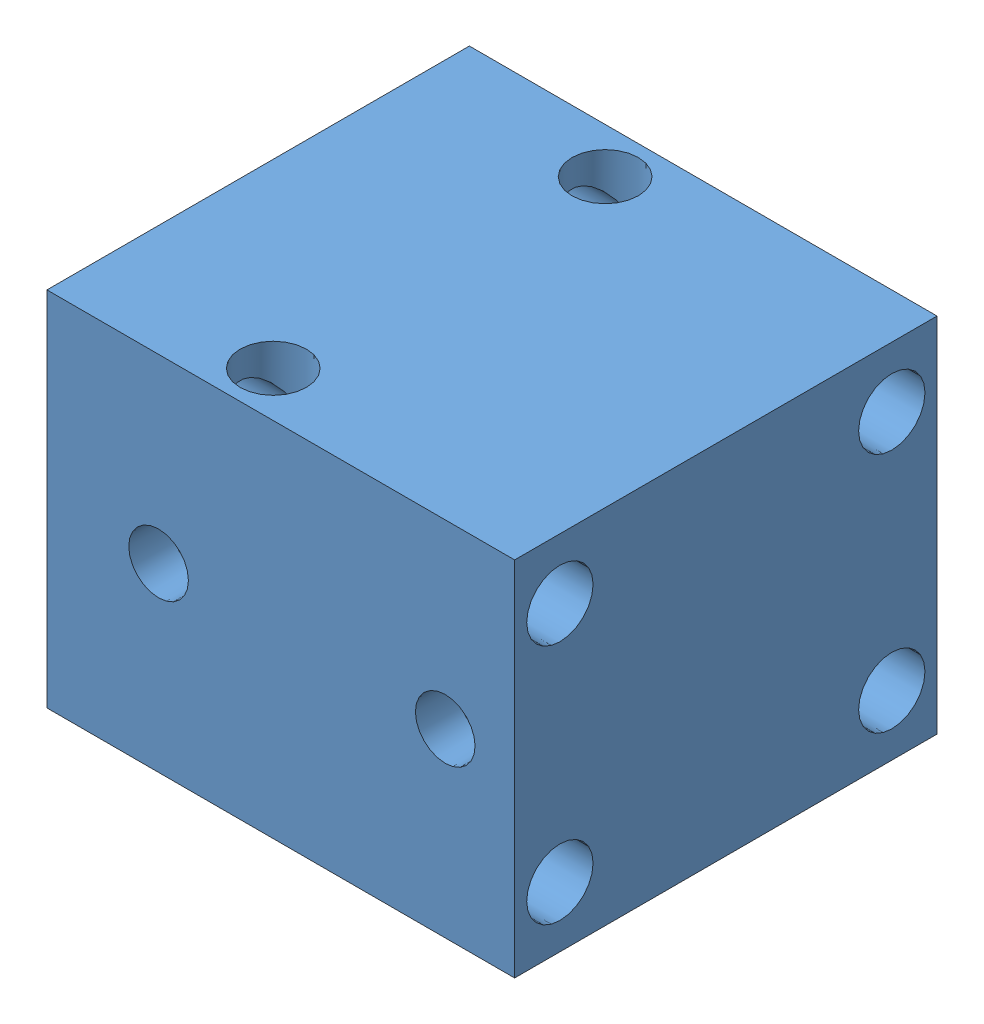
SolidWorks assembly 0802.SLDASM, configuration Default (file format 4400). Lengths in mm.
Overall size (180 120 140).
2 component instances, 2 part files, 3 mates.
Components (placement in the parent):
- 0801-1: 0801.SLDPRT [Default] at (23.0827 -70.5585 -28.9476) size (155 120 140)
- 0802-FP-1: 0802-FP.SLDPRT [Default] at (-79.4173 -10.5585 -28.9476) x (0 0 1) z (-1 0 0) size (50 50 100)
Mates (geometry in assembly coordinates):
- Concentric1: concentric aligned: cylinder of 0801-1 through (5.5827 -10.5585 -28.9476) axis (-1 0 0) radius 1.5; cylinder of 0802-FP-1 through (20.5827 -10.5585 -28.9476) axis (-1 0 0) radius 25
- Distance1: distance = 25 mm aligned: plane of 0801-1 through (-54.4173 49.4415 -98.9476) normal (-1 0 0); plane of 0802-FP-1 through (-79.4173 -10.5585 -28.9476) normal (-1 0 0)
- Parallel1: parallel aligned: plane of 0801-1 through (-54.4173 49.4415 41.0524) normal (0 0 1); plane of 0802-FP-1 through (-79.4173 -21.0585 -4.9476) normal (0 0 1)
